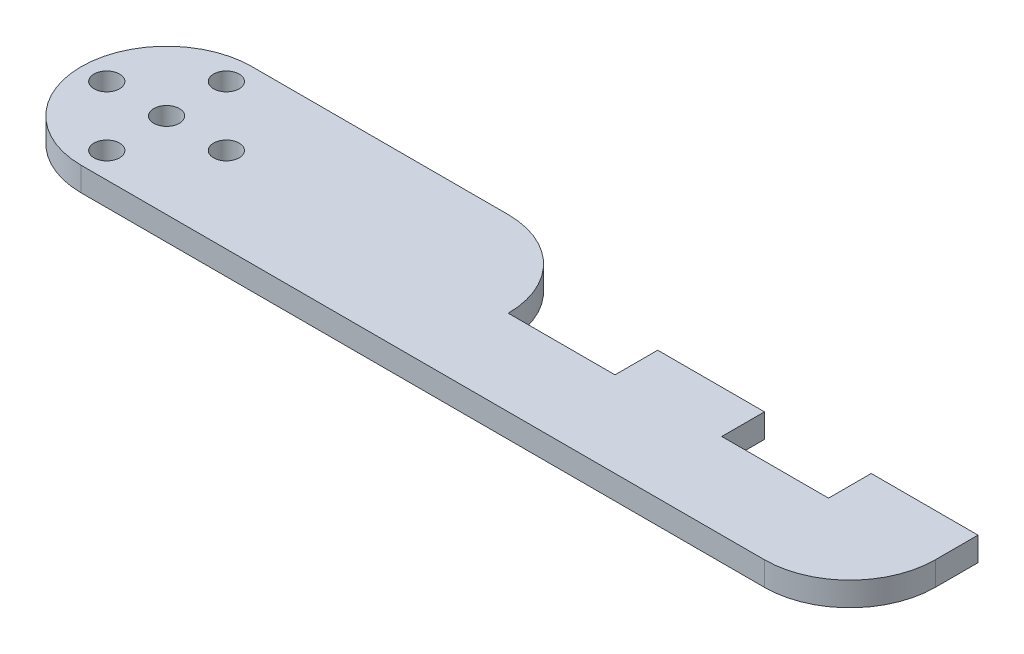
ISO-10303-21;
HEADER;
FILE_DESCRIPTION(('STEP AP214'),'2;1');
FILE_NAME('part.step','',(''),(''),'','','');
FILE_SCHEMA(('AUTOMOTIVE_DESIGN { 1 0 10303 214 1 1 1 1 }'));
ENDSEC;
DATA;
#1=APPLICATION_CONTEXT('core data for automotive mechanical design processes');
#2=APPLICATION_PROTOCOL_DEFINITION('international standard','automotive_design',2000,#1);
#3=PRODUCT_CONTEXT('',#1,'mechanical');
#4=PRODUCT('Part','Part','',(#3));
#5=PRODUCT_RELATED_PRODUCT_CATEGORY('part','',(#4));
#6=PRODUCT_DEFINITION_FORMATION('','',#4);
#7=PRODUCT_DEFINITION_CONTEXT('part definition',#1,'design');
#8=PRODUCT_DEFINITION('design','',#6,#7);
#9=PRODUCT_DEFINITION_SHAPE('','',#8);
#10=(LENGTH_UNIT() NAMED_UNIT(*) SI_UNIT(.MILLI.,.METRE.));
#11=(NAMED_UNIT(*) PLANE_ANGLE_UNIT() SI_UNIT($,.RADIAN.));
#12=(NAMED_UNIT(*) SI_UNIT($,.STERADIAN.) SOLID_ANGLE_UNIT());
#13=UNCERTAINTY_MEASURE_WITH_UNIT(LENGTH_MEASURE(1.E-05),#10,'distance_accuracy_value','');
#14=(GEOMETRIC_REPRESENTATION_CONTEXT(3) GLOBAL_UNCERTAINTY_ASSIGNED_CONTEXT((#13)) GLOBAL_UNIT_ASSIGNED_CONTEXT((#10,
#11,#12)) REPRESENTATION_CONTEXT('',''));
#15=CARTESIAN_POINT('',(0.,0.,0.));
#16=DIRECTION('',(0.,0.,1.));
#17=DIRECTION('',(1.,0.,0.));
#18=AXIS2_PLACEMENT_3D('',#15,#16,#17);
#19=CARTESIAN_POINT('',(0.,2.8,0.));
#20=DIRECTION('',(0.,0.,-1.));
#21=DIRECTION('',(-1.,0.,0.));
#22=AXIS2_PLACEMENT_3D('',#19,#20,#21);
#23=PLANE('',#22);
#24=DIRECTION('',(1.,0.,0.));
#25=VECTOR('',#24,1.);
#26=CARTESIAN_POINT('',(0.,0.,0.));
#27=LINE('',#26,#25);
#28=CARTESIAN_POINT('',(10.,0.,0.));
#29=VERTEX_POINT('',#28);
#30=CARTESIAN_POINT('',(90.,0.,0.));
#31=VERTEX_POINT('',#30);
#32=EDGE_CURVE('E175',#29,#31,#27,.T.);
#33=ORIENTED_EDGE('',*,*,#32,.T.);
#34=DIRECTION('',(0.,-1.,0.));
#35=VECTOR('',#34,1.);
#36=CARTESIAN_POINT('',(90.,2.8,0.));
#37=LINE('',#36,#35);
#38=CARTESIAN_POINT('',(90.,2.8,0.));
#39=VERTEX_POINT('',#38);
#40=EDGE_CURVE('E41',#31,#39,#37,.F.);
#41=ORIENTED_EDGE('',*,*,#40,.T.);
#42=DIRECTION('',(1.,0.,0.));
#43=VECTOR('',#42,1.);
#44=CARTESIAN_POINT('',(0.,2.8,0.));
#45=LINE('',#44,#43);
#46=CARTESIAN_POINT('',(10.,2.8,0.));
#47=VERTEX_POINT('',#46);
#48=EDGE_CURVE('E143',#47,#39,#45,.T.);
#49=ORIENTED_EDGE('',*,*,#48,.F.);
#50=DIRECTION('',(0.,-1.,0.));
#51=VECTOR('',#50,1.);
#52=CARTESIAN_POINT('',(10.,2.8,0.));
#53=LINE('',#52,#51);
#54=EDGE_CURVE('E225',#47,#29,#53,.T.);
#55=ORIENTED_EDGE('',*,*,#54,.T.);
#56=EDGE_LOOP('',(#33,#41,#49,#55));
#57=FACE_BOUND('',#56,.T.);
#58=ADVANCED_FACE('F33',(#57),#23,.F.);
#59=CARTESIAN_POINT('',(100.,2.8,-15.));
#60=DIRECTION('',(-1.,0.,0.));
#61=DIRECTION('',(0.,0.,1.));
#62=AXIS2_PLACEMENT_3D('',#59,#60,#61);
#63=PLANE('',#62);
#64=DIRECTION('',(0.,0.,-1.));
#65=VECTOR('',#64,1.);
#66=CARTESIAN_POINT('',(100.,2.8,-15.));
#67=LINE('',#66,#65);
#68=CARTESIAN_POINT('',(100.,2.8,-10.));
#69=VERTEX_POINT('',#68);
#70=CARTESIAN_POINT('',(100.,2.8,-15.));
#71=VERTEX_POINT('',#70);
#72=EDGE_CURVE('E133',#69,#71,#67,.T.);
#73=ORIENTED_EDGE('',*,*,#72,.F.);
#74=DIRECTION('',(0.,-1.,0.));
#75=VECTOR('',#74,1.);
#76=CARTESIAN_POINT('',(100.,2.8,-10.));
#77=LINE('',#76,#75);
#78=CARTESIAN_POINT('',(100.,0.,-10.));
#79=VERTEX_POINT('',#78);
#80=EDGE_CURVE('E237',#69,#79,#77,.T.);
#81=ORIENTED_EDGE('',*,*,#80,.T.);
#82=DIRECTION('',(0.,0.,-1.));
#83=VECTOR('',#82,1.);
#84=CARTESIAN_POINT('',(100.,0.,-15.));
#85=LINE('',#84,#83);
#86=CARTESIAN_POINT('',(100.,0.,-15.));
#87=VERTEX_POINT('',#86);
#88=EDGE_CURVE('E148',#79,#87,#85,.T.);
#89=ORIENTED_EDGE('',*,*,#88,.T.);
#90=DIRECTION('',(0.,-1.,0.));
#91=VECTOR('',#90,1.);
#92=CARTESIAN_POINT('',(100.,2.8,-15.));
#93=LINE('',#92,#91);
#94=EDGE_CURVE('E146',#71,#87,#93,.T.);
#95=ORIENTED_EDGE('',*,*,#94,.F.);
#96=EDGE_LOOP('',(#73,#81,#89,#95));
#97=FACE_BOUND('',#96,.T.);
#98=ADVANCED_FACE('F147',(#97),#63,.F.);
#99=CARTESIAN_POINT('',(87.5,2.8,-15.));
#100=DIRECTION('',(0.,0.,1.));
#101=DIRECTION('',(1.,0.,0.));
#102=AXIS2_PLACEMENT_3D('',#99,#100,#101);
#103=PLANE('',#102);
#104=DIRECTION('',(-1.,0.,0.));
#105=VECTOR('',#104,1.);
#106=CARTESIAN_POINT('',(87.5,0.,-15.));
#107=LINE('',#106,#105);
#108=CARTESIAN_POINT('',(87.5,0.,-15.));
#109=VERTEX_POINT('',#108);
#110=EDGE_CURVE('E179',#87,#109,#107,.T.);
#111=ORIENTED_EDGE('',*,*,#110,.T.);
#112=DIRECTION('',(0.,-1.,0.));
#113=VECTOR('',#112,1.);
#114=CARTESIAN_POINT('',(87.5,2.8,-15.));
#115=LINE('',#114,#113);
#116=CARTESIAN_POINT('',(87.5,2.8,-15.));
#117=VERTEX_POINT('',#116);
#118=EDGE_CURVE('E152',#117,#109,#115,.T.);
#119=ORIENTED_EDGE('',*,*,#118,.F.);
#120=DIRECTION('',(-1.,0.,0.));
#121=VECTOR('',#120,1.);
#122=CARTESIAN_POINT('',(87.5,2.8,-15.));
#123=LINE('',#122,#121);
#124=EDGE_CURVE('E137',#71,#117,#123,.T.);
#125=ORIENTED_EDGE('',*,*,#124,.F.);
#126=ORIENTED_EDGE('',*,*,#94,.T.);
#127=EDGE_LOOP('',(#111,#119,#125,#126));
#128=FACE_BOUND('',#127,.T.);
#129=ADVANCED_FACE('F154',(#128),#103,.F.);
#130=CARTESIAN_POINT('',(87.5,2.8,-10.));
#131=DIRECTION('',(1.,0.,0.));
#132=DIRECTION('',(0.,0.,-1.));
#133=AXIS2_PLACEMENT_3D('',#130,#131,#132);
#134=PLANE('',#133);
#135=DIRECTION('',(0.,0.,1.));
#136=VECTOR('',#135,1.);
#137=CARTESIAN_POINT('',(87.5,0.,-10.));
#138=LINE('',#137,#136);
#139=CARTESIAN_POINT('',(87.5,0.,-10.));
#140=VERTEX_POINT('',#139);
#141=EDGE_CURVE('E181',#109,#140,#138,.T.);
#142=ORIENTED_EDGE('',*,*,#141,.T.);
#143=DIRECTION('',(0.,-1.,0.));
#144=VECTOR('',#143,1.);
#145=CARTESIAN_POINT('',(87.5,2.8,-10.));
#146=LINE('',#145,#144);
#147=CARTESIAN_POINT('',(87.5,2.8,-10.));
#148=VERTEX_POINT('',#147);
#149=EDGE_CURVE('E210',#148,#140,#146,.T.);
#150=ORIENTED_EDGE('',*,*,#149,.F.);
#151=DIRECTION('',(0.,0.,1.));
#152=VECTOR('',#151,1.);
#153=CARTESIAN_POINT('',(87.5,2.8,-10.));
#154=LINE('',#153,#152);
#155=EDGE_CURVE('E157',#117,#148,#154,.T.);
#156=ORIENTED_EDGE('',*,*,#155,.F.);
#157=ORIENTED_EDGE('',*,*,#118,.T.);
#158=EDGE_LOOP('',(#142,#150,#156,#157));
#159=FACE_BOUND('',#158,.T.);
#160=ADVANCED_FACE('F244',(#159),#134,.F.);
#161=CARTESIAN_POINT('',(75.,2.8,-10.));
#162=DIRECTION('',(0.,0.,1.));
#163=DIRECTION('',(1.,0.,0.));
#164=AXIS2_PLACEMENT_3D('',#161,#162,#163);
#165=PLANE('',#164);
#166=DIRECTION('',(-1.,0.,0.));
#167=VECTOR('',#166,1.);
#168=CARTESIAN_POINT('',(75.,0.,-10.));
#169=LINE('',#168,#167);
#170=CARTESIAN_POINT('',(75.,0.,-10.));
#171=VERTEX_POINT('',#170);
#172=EDGE_CURVE('E183',#140,#171,#169,.T.);
#173=ORIENTED_EDGE('',*,*,#172,.T.);
#174=DIRECTION('',(0.,-1.,0.));
#175=VECTOR('',#174,1.);
#176=CARTESIAN_POINT('',(75.,2.8,-10.));
#177=LINE('',#176,#175);
#178=CARTESIAN_POINT('',(75.,2.8,-10.));
#179=VERTEX_POINT('',#178);
#180=EDGE_CURVE('E207',#179,#171,#177,.T.);
#181=ORIENTED_EDGE('',*,*,#180,.F.);
#182=DIRECTION('',(-1.,0.,0.));
#183=VECTOR('',#182,1.);
#184=CARTESIAN_POINT('',(75.,2.8,-10.));
#185=LINE('',#184,#183);
#186=EDGE_CURVE('E159',#148,#179,#185,.T.);
#187=ORIENTED_EDGE('',*,*,#186,.F.);
#188=ORIENTED_EDGE('',*,*,#149,.T.);
#189=EDGE_LOOP('',(#173,#181,#187,#188));
#190=FACE_BOUND('',#189,.T.);
#191=ADVANCED_FACE('F251',(#190),#165,.F.);
#192=CARTESIAN_POINT('',(75.,2.8,-15.));
#193=DIRECTION('',(-1.,0.,0.));
#194=DIRECTION('',(0.,0.,1.));
#195=AXIS2_PLACEMENT_3D('',#192,#193,#194);
#196=PLANE('',#195);
#197=DIRECTION('',(0.,0.,-1.));
#198=VECTOR('',#197,1.);
#199=CARTESIAN_POINT('',(75.,0.,-15.));
#200=LINE('',#199,#198);
#201=CARTESIAN_POINT('',(75.,0.,-15.));
#202=VERTEX_POINT('',#201);
#203=EDGE_CURVE('E185',#171,#202,#200,.T.);
#204=ORIENTED_EDGE('',*,*,#203,.T.);
#205=DIRECTION('',(0.,-1.,0.));
#206=VECTOR('',#205,1.);
#207=CARTESIAN_POINT('',(75.,2.8,-15.));
#208=LINE('',#207,#206);
#209=CARTESIAN_POINT('',(75.,2.8,-15.));
#210=VERTEX_POINT('',#209);
#211=EDGE_CURVE('E204',#210,#202,#208,.T.);
#212=ORIENTED_EDGE('',*,*,#211,.F.);
#213=DIRECTION('',(0.,0.,-1.));
#214=VECTOR('',#213,1.);
#215=CARTESIAN_POINT('',(75.,2.8,-15.));
#216=LINE('',#215,#214);
#217=EDGE_CURVE('E164',#179,#210,#216,.T.);
#218=ORIENTED_EDGE('',*,*,#217,.F.);
#219=ORIENTED_EDGE('',*,*,#180,.T.);
#220=EDGE_LOOP('',(#204,#212,#218,#219));
#221=FACE_BOUND('',#220,.T.);
#222=ADVANCED_FACE('F254',(#221),#196,.F.);
#223=CARTESIAN_POINT('',(62.5,2.8,-15.));
#224=DIRECTION('',(0.,0.,1.));
#225=DIRECTION('',(1.,0.,0.));
#226=AXIS2_PLACEMENT_3D('',#223,#224,#225);
#227=PLANE('',#226);
#228=DIRECTION('',(-1.,0.,0.));
#229=VECTOR('',#228,1.);
#230=CARTESIAN_POINT('',(62.5,0.,-15.));
#231=LINE('',#230,#229);
#232=CARTESIAN_POINT('',(62.5,0.,-15.));
#233=VERTEX_POINT('',#232);
#234=EDGE_CURVE('E187',#202,#233,#231,.T.);
#235=ORIENTED_EDGE('',*,*,#234,.T.);
#236=DIRECTION('',(0.,-1.,0.));
#237=VECTOR('',#236,1.);
#238=CARTESIAN_POINT('',(62.5,2.8,-15.));
#239=LINE('',#238,#237);
#240=CARTESIAN_POINT('',(62.5,2.8,-15.));
#241=VERTEX_POINT('',#240);
#242=EDGE_CURVE('E201',#241,#233,#239,.T.);
#243=ORIENTED_EDGE('',*,*,#242,.F.);
#244=DIRECTION('',(-1.,0.,0.));
#245=VECTOR('',#244,1.);
#246=CARTESIAN_POINT('',(62.5,2.8,-15.));
#247=LINE('',#246,#245);
#248=EDGE_CURVE('E166',#210,#241,#247,.T.);
#249=ORIENTED_EDGE('',*,*,#248,.F.);
#250=ORIENTED_EDGE('',*,*,#211,.T.);
#251=EDGE_LOOP('',(#235,#243,#249,#250));
#252=FACE_BOUND('',#251,.T.);
#253=ADVANCED_FACE('F259',(#252),#227,.F.);
#254=CARTESIAN_POINT('',(62.5,2.8,-10.));
#255=DIRECTION('',(1.,0.,0.));
#256=DIRECTION('',(0.,0.,-1.));
#257=AXIS2_PLACEMENT_3D('',#254,#255,#256);
#258=PLANE('',#257);
#259=DIRECTION('',(0.,0.,1.));
#260=VECTOR('',#259,1.);
#261=CARTESIAN_POINT('',(62.5,0.,-10.));
#262=LINE('',#261,#260);
#263=CARTESIAN_POINT('',(62.5,0.,-10.));
#264=VERTEX_POINT('',#263);
#265=EDGE_CURVE('E189',#233,#264,#262,.T.);
#266=ORIENTED_EDGE('',*,*,#265,.T.);
#267=DIRECTION('',(0.,-1.,0.));
#268=VECTOR('',#267,1.);
#269=CARTESIAN_POINT('',(62.5,2.8,-10.));
#270=LINE('',#269,#268);
#271=CARTESIAN_POINT('',(62.5,2.8,-10.));
#272=VERTEX_POINT('',#271);
#273=EDGE_CURVE('E198',#272,#264,#270,.T.);
#274=ORIENTED_EDGE('',*,*,#273,.F.);
#275=DIRECTION('',(0.,0.,1.));
#276=VECTOR('',#275,1.);
#277=CARTESIAN_POINT('',(62.5,2.8,-10.));
#278=LINE('',#277,#276);
#279=EDGE_CURVE('E168',#241,#272,#278,.T.);
#280=ORIENTED_EDGE('',*,*,#279,.F.);
#281=ORIENTED_EDGE('',*,*,#242,.T.);
#282=EDGE_LOOP('',(#266,#274,#280,#281));
#283=FACE_BOUND('',#282,.T.);
#284=ADVANCED_FACE('F265',(#283),#258,.F.);
#285=CARTESIAN_POINT('',(50.,2.8,-10.));
#286=DIRECTION('',(0.,0.,1.));
#287=DIRECTION('',(1.,0.,0.));
#288=AXIS2_PLACEMENT_3D('',#285,#286,#287);
#289=PLANE('',#288);
#290=DIRECTION('',(-1.,0.,0.));
#291=VECTOR('',#290,1.);
#292=CARTESIAN_POINT('',(50.,0.,-10.));
#293=LINE('',#292,#291);
#294=CARTESIAN_POINT('',(50.,0.,-10.));
#295=VERTEX_POINT('',#294);
#296=EDGE_CURVE('E191',#264,#295,#293,.T.);
#297=ORIENTED_EDGE('',*,*,#296,.T.);
#298=DIRECTION('',(0.,-1.,0.));
#299=VECTOR('',#298,1.);
#300=CARTESIAN_POINT('',(50.,2.8,-10.));
#301=LINE('',#300,#299);
#302=CARTESIAN_POINT('',(50.,2.8,-10.));
#303=VERTEX_POINT('',#302);
#304=EDGE_CURVE('E174',#303,#295,#301,.T.);
#305=ORIENTED_EDGE('',*,*,#304,.F.);
#306=DIRECTION('',(-1.,0.,0.));
#307=VECTOR('',#306,1.);
#308=CARTESIAN_POINT('',(50.,2.8,-10.));
#309=LINE('',#308,#307);
#310=EDGE_CURVE('E170',#272,#303,#309,.T.);
#311=ORIENTED_EDGE('',*,*,#310,.F.);
#312=ORIENTED_EDGE('',*,*,#273,.T.);
#313=EDGE_LOOP('',(#297,#305,#311,#312));
#314=FACE_BOUND('',#313,.T.);
#315=ADVANCED_FACE('F269',(#314),#289,.F.);
#316=CARTESIAN_POINT('',(50.,2.8,-20.));
#317=DIRECTION('',(0.,0.,1.));
#318=DIRECTION('',(1.,0.,0.));
#319=AXIS2_PLACEMENT_3D('',#316,#317,#318);
#320=PLANE('',#319);
#321=DIRECTION('',(-1.,0.,0.));
#322=VECTOR('',#321,1.);
#323=CARTESIAN_POINT('',(50.,2.8,-20.));
#324=LINE('',#323,#322);
#325=CARTESIAN_POINT('',(40.,2.8,-20.));
#326=VERTEX_POINT('',#325);
#327=CARTESIAN_POINT('',(10.,2.8,-20.));
#328=VERTEX_POINT('',#327);
#329=EDGE_CURVE('E172',#326,#328,#324,.T.);
#330=ORIENTED_EDGE('',*,*,#329,.F.);
#331=DIRECTION('',(0.,-1.,0.));
#332=VECTOR('',#331,1.);
#333=CARTESIAN_POINT('',(40.,2.8,-20.));
#334=LINE('',#333,#332);
#335=CARTESIAN_POINT('',(40.,0.,-20.));
#336=VERTEX_POINT('',#335);
#337=EDGE_CURVE('E227',#326,#336,#334,.T.);
#338=ORIENTED_EDGE('',*,*,#337,.T.);
#339=DIRECTION('',(-1.,0.,0.));
#340=VECTOR('',#339,1.);
#341=CARTESIAN_POINT('',(50.,0.,-20.));
#342=LINE('',#341,#340);
#343=CARTESIAN_POINT('',(10.,0.,-20.));
#344=VERTEX_POINT('',#343);
#345=EDGE_CURVE('E194',#336,#344,#342,.T.);
#346=ORIENTED_EDGE('',*,*,#345,.T.);
#347=DIRECTION('',(0.,-1.,0.));
#348=VECTOR('',#347,1.);
#349=CARTESIAN_POINT('',(10.,2.8,-20.));
#350=LINE('',#349,#348);
#351=EDGE_CURVE('E218',#344,#328,#350,.F.);
#352=ORIENTED_EDGE('',*,*,#351,.T.);
#353=EDGE_LOOP('',(#330,#338,#346,#352));
#354=FACE_BOUND('',#353,.T.);
#355=ADVANCED_FACE('F277',(#354),#320,.F.);
#356=CARTESIAN_POINT('',(0.,2.8,0.));
#357=DIRECTION('',(0.,1.,0.));
#358=DIRECTION('',(0.,0.,1.));
#359=AXIS2_PLACEMENT_3D('',#356,#357,#358);
#360=PLANE('',#359);
#361=CARTESIAN_POINT('',(3.,2.8,-10.));
#362=DIRECTION('',(0.,1.,0.));
#363=DIRECTION('',(0.,0.,1.));
#364=AXIS2_PLACEMENT_3D('',#361,#362,#363);
#365=CIRCLE('',#364,1.5);
#366=CARTESIAN_POINT('',(3.,2.8,-8.5));
#367=VERTEX_POINT('',#366);
#368=EDGE_CURVE('E303',#367,#367,#365,.T.);
#369=ORIENTED_EDGE('',*,*,#368,.F.);
#370=EDGE_LOOP('',(#369));
#371=FACE_BOUND('',#370,.T.);
#372=CARTESIAN_POINT('',(10.,2.8,-3.));
#373=DIRECTION('',(0.,1.,0.));
#374=DIRECTION('',(0.,0.,1.));
#375=AXIS2_PLACEMENT_3D('',#372,#373,#374);
#376=CIRCLE('',#375,1.5);
#377=CARTESIAN_POINT('',(10.,2.8,-1.5));
#378=VERTEX_POINT('',#377);
#379=EDGE_CURVE('E296',#378,#378,#376,.T.);
#380=ORIENTED_EDGE('',*,*,#379,.F.);
#381=EDGE_LOOP('',(#380));
#382=FACE_BOUND('',#381,.T.);
#383=CARTESIAN_POINT('',(17.,2.8,-10.));
#384=DIRECTION('',(0.,1.,0.));
#385=DIRECTION('',(0.,0.,1.));
#386=AXIS2_PLACEMENT_3D('',#383,#384,#385);
#387=CIRCLE('',#386,1.5);
#388=CARTESIAN_POINT('',(17.,2.8,-8.5));
#389=VERTEX_POINT('',#388);
#390=EDGE_CURVE('E314',#389,#389,#387,.T.);
#391=ORIENTED_EDGE('',*,*,#390,.F.);
#392=EDGE_LOOP('',(#391));
#393=FACE_BOUND('',#392,.T.);
#394=CARTESIAN_POINT('',(10.,2.8,-17.));
#395=DIRECTION('',(0.,1.,0.));
#396=DIRECTION('',(0.,0.,1.));
#397=AXIS2_PLACEMENT_3D('',#394,#395,#396);
#398=CIRCLE('',#397,1.5);
#399=CARTESIAN_POINT('',(10.,2.8,-15.5));
#400=VERTEX_POINT('',#399);
#401=EDGE_CURVE('E308',#400,#400,#398,.T.);
#402=ORIENTED_EDGE('',*,*,#401,.F.);
#403=EDGE_LOOP('',(#402));
#404=FACE_BOUND('',#403,.T.);
#405=CARTESIAN_POINT('',(10.,2.8,-10.));
#406=DIRECTION('',(0.,1.,0.));
#407=DIRECTION('',(0.,0.,1.));
#408=AXIS2_PLACEMENT_3D('',#405,#406,#407);
#409=CIRCLE('',#408,1.5);
#410=CARTESIAN_POINT('',(10.,2.8,-8.5));
#411=VERTEX_POINT('',#410);
#412=EDGE_CURVE('E290',#411,#411,#409,.T.);
#413=ORIENTED_EDGE('',*,*,#412,.F.);
#414=EDGE_LOOP('',(#413));
#415=FACE_BOUND('',#414,.T.);
#416=ORIENTED_EDGE('',*,*,#48,.T.);
#417=CARTESIAN_POINT('',(90.,2.8,-10.));
#418=DIRECTION('',(0.,1.,0.));
#419=DIRECTION('',(0.,0.,1.));
#420=AXIS2_PLACEMENT_3D('',#417,#418,#419);
#421=CIRCLE('',#420,10.);
#422=EDGE_CURVE('E11',#39,#69,#421,.T.);
#423=ORIENTED_EDGE('',*,*,#422,.T.);
#424=ORIENTED_EDGE('',*,*,#72,.T.);
#425=ORIENTED_EDGE('',*,*,#124,.T.);
#426=ORIENTED_EDGE('',*,*,#155,.T.);
#427=ORIENTED_EDGE('',*,*,#186,.T.);
#428=ORIENTED_EDGE('',*,*,#217,.T.);
#429=ORIENTED_EDGE('',*,*,#248,.T.);
#430=ORIENTED_EDGE('',*,*,#279,.T.);
#431=ORIENTED_EDGE('',*,*,#310,.T.);
#432=CARTESIAN_POINT('',(40.,2.8,-10.));
#433=DIRECTION('',(0.,1.,0.));
#434=DIRECTION('',(0.,0.,1.));
#435=AXIS2_PLACEMENT_3D('',#432,#433,#434);
#436=CIRCLE('',#435,10.);
#437=EDGE_CURVE('E235',#303,#326,#436,.T.);
#438=ORIENTED_EDGE('',*,*,#437,.T.);
#439=ORIENTED_EDGE('',*,*,#329,.T.);
#440=CARTESIAN_POINT('',(10.,2.8,-10.));
#441=DIRECTION('',(0.,1.,0.));
#442=DIRECTION('',(0.,0.,1.));
#443=AXIS2_PLACEMENT_3D('',#440,#441,#442);
#444=CIRCLE('',#443,10.);
#445=CARTESIAN_POINT('',(0.,2.8,-10.));
#446=VERTEX_POINT('',#445);
#447=EDGE_CURVE('E223',#328,#446,#444,.T.);
#448=ORIENTED_EDGE('',*,*,#447,.T.);
#449=CARTESIAN_POINT('',(10.,2.8,-10.));
#450=DIRECTION('',(0.,1.,0.));
#451=DIRECTION('',(0.,0.,1.));
#452=AXIS2_PLACEMENT_3D('',#449,#450,#451);
#453=CIRCLE('',#452,10.);
#454=EDGE_CURVE('E221',#446,#47,#453,.T.);
#455=ORIENTED_EDGE('',*,*,#454,.T.);
#456=EDGE_LOOP('',(#416,#423,#424,#425,#426,#427,#428,#429,#430,#431,#438,#439,#448,#455));
#457=FACE_BOUND('',#456,.T.);
#458=ADVANCED_FACE('F135',(#371,#382,#393,#404,#415,#457),#360,.T.);
#459=CARTESIAN_POINT('',(0.,0.,0.));
#460=DIRECTION('',(0.,1.,0.));
#461=DIRECTION('',(0.,0.,1.));
#462=AXIS2_PLACEMENT_3D('',#459,#460,#461);
#463=PLANE('',#462);
#464=CARTESIAN_POINT('',(3.,0.,-10.));
#465=DIRECTION('',(0.,1.,0.));
#466=DIRECTION('',(0.,0.,1.));
#467=AXIS2_PLACEMENT_3D('',#464,#465,#466);
#468=CIRCLE('',#467,1.5);
#469=CARTESIAN_POINT('',(3.,0.,-8.5));
#470=VERTEX_POINT('',#469);
#471=EDGE_CURVE('E293',#470,#470,#468,.T.);
#472=ORIENTED_EDGE('',*,*,#471,.T.);
#473=EDGE_LOOP('',(#472));
#474=FACE_BOUND('',#473,.T.);
#475=CARTESIAN_POINT('',(10.,0.,-3.));
#476=DIRECTION('',(0.,1.,0.));
#477=DIRECTION('',(0.,0.,1.));
#478=AXIS2_PLACEMENT_3D('',#475,#476,#477);
#479=CIRCLE('',#478,1.5);
#480=CARTESIAN_POINT('',(10.,0.,-1.5));
#481=VERTEX_POINT('',#480);
#482=EDGE_CURVE('E299',#481,#481,#479,.T.);
#483=ORIENTED_EDGE('',*,*,#482,.T.);
#484=EDGE_LOOP('',(#483));
#485=FACE_BOUND('',#484,.T.);
#486=CARTESIAN_POINT('',(17.,0.,-10.));
#487=DIRECTION('',(0.,1.,0.));
#488=DIRECTION('',(0.,0.,1.));
#489=AXIS2_PLACEMENT_3D('',#486,#487,#488);
#490=CIRCLE('',#489,1.5);
#491=CARTESIAN_POINT('',(17.,0.,-8.5));
#492=VERTEX_POINT('',#491);
#493=EDGE_CURVE('E300',#492,#492,#490,.T.);
#494=ORIENTED_EDGE('',*,*,#493,.T.);
#495=EDGE_LOOP('',(#494));
#496=FACE_BOUND('',#495,.T.);
#497=CARTESIAN_POINT('',(10.,0.,-17.));
#498=DIRECTION('',(0.,1.,0.));
#499=DIRECTION('',(0.,0.,1.));
#500=AXIS2_PLACEMENT_3D('',#497,#498,#499);
#501=CIRCLE('',#500,1.5);
#502=CARTESIAN_POINT('',(10.,0.,-15.5));
#503=VERTEX_POINT('',#502);
#504=EDGE_CURVE('E311',#503,#503,#501,.T.);
#505=ORIENTED_EDGE('',*,*,#504,.T.);
#506=EDGE_LOOP('',(#505));
#507=FACE_BOUND('',#506,.T.);
#508=CARTESIAN_POINT('',(10.,0.,-10.));
#509=DIRECTION('',(0.,1.,0.));
#510=DIRECTION('',(0.,0.,1.));
#511=AXIS2_PLACEMENT_3D('',#508,#509,#510);
#512=CIRCLE('',#511,1.5);
#513=CARTESIAN_POINT('',(10.,0.,-8.5));
#514=VERTEX_POINT('',#513);
#515=EDGE_CURVE('E230',#514,#514,#512,.T.);
#516=ORIENTED_EDGE('',*,*,#515,.T.);
#517=EDGE_LOOP('',(#516));
#518=FACE_BOUND('',#517,.T.);
#519=ORIENTED_EDGE('',*,*,#88,.F.);
#520=CARTESIAN_POINT('',(90.,0.,-10.));
#521=DIRECTION('',(0.,1.,0.));
#522=DIRECTION('',(0.,0.,1.));
#523=AXIS2_PLACEMENT_3D('',#520,#521,#522);
#524=CIRCLE('',#523,10.);
#525=EDGE_CURVE('E55',#79,#31,#524,.F.);
#526=ORIENTED_EDGE('',*,*,#525,.T.);
#527=ORIENTED_EDGE('',*,*,#32,.F.);
#528=CARTESIAN_POINT('',(10.,0.,-10.));
#529=DIRECTION('',(0.,1.,0.));
#530=DIRECTION('',(0.,0.,1.));
#531=AXIS2_PLACEMENT_3D('',#528,#529,#530);
#532=CIRCLE('',#531,10.);
#533=CARTESIAN_POINT('',(0.,0.,-10.));
#534=VERTEX_POINT('',#533);
#535=EDGE_CURVE('E151',#29,#534,#532,.F.);
#536=ORIENTED_EDGE('',*,*,#535,.T.);
#537=CARTESIAN_POINT('',(10.,0.,-10.));
#538=DIRECTION('',(0.,1.,0.));
#539=DIRECTION('',(0.,0.,1.));
#540=AXIS2_PLACEMENT_3D('',#537,#538,#539);
#541=CIRCLE('',#540,10.);
#542=EDGE_CURVE('E215',#534,#344,#541,.F.);
#543=ORIENTED_EDGE('',*,*,#542,.T.);
#544=ORIENTED_EDGE('',*,*,#345,.F.);
#545=CARTESIAN_POINT('',(40.,0.,-10.));
#546=DIRECTION('',(0.,1.,0.));
#547=DIRECTION('',(0.,0.,1.));
#548=AXIS2_PLACEMENT_3D('',#545,#546,#547);
#549=CIRCLE('',#548,10.);
#550=EDGE_CURVE('E233',#336,#295,#549,.F.);
#551=ORIENTED_EDGE('',*,*,#550,.T.);
#552=ORIENTED_EDGE('',*,*,#296,.F.);
#553=ORIENTED_EDGE('',*,*,#265,.F.);
#554=ORIENTED_EDGE('',*,*,#234,.F.);
#555=ORIENTED_EDGE('',*,*,#203,.F.);
#556=ORIENTED_EDGE('',*,*,#172,.F.);
#557=ORIENTED_EDGE('',*,*,#141,.F.);
#558=ORIENTED_EDGE('',*,*,#110,.F.);
#559=EDGE_LOOP('',(#519,#526,#527,#536,#543,#544,#551,#552,#553,#554,#555,#556,#557,#558));
#560=FACE_BOUND('',#559,.T.);
#561=ADVANCED_FACE('F240',(#474,#485,#496,#507,#518,#560),#463,.F.);
#562=CARTESIAN_POINT('',(10.,2.8,-10.));
#563=DIRECTION('',(0.,-1.,0.));
#564=DIRECTION('',(0.,0.,-1.));
#565=AXIS2_PLACEMENT_3D('',#562,#563,#564);
#566=CYLINDRICAL_SURFACE('',#565,10.);
#567=ORIENTED_EDGE('',*,*,#54,.F.);
#568=ORIENTED_EDGE('',*,*,#454,.F.);
#569=DIRECTION('',(0.,-1.,0.));
#570=VECTOR('',#569,1.);
#571=CARTESIAN_POINT('',(0.,2.8,-10.));
#572=LINE('',#571,#570);
#573=EDGE_CURVE('E177',#534,#446,#572,.F.);
#574=ORIENTED_EDGE('',*,*,#573,.F.);
#575=ORIENTED_EDGE('',*,*,#535,.F.);
#576=EDGE_LOOP('',(#567,#568,#574,#575));
#577=FACE_BOUND('',#576,.T.);
#578=ADVANCED_FACE('F287',(#577),#566,.T.);
#579=CARTESIAN_POINT('',(10.,2.8,-10.));
#580=DIRECTION('',(0.,-1.,0.));
#581=DIRECTION('',(0.,0.,-1.));
#582=AXIS2_PLACEMENT_3D('',#579,#580,#581);
#583=CYLINDRICAL_SURFACE('',#582,10.);
#584=ORIENTED_EDGE('',*,*,#447,.F.);
#585=ORIENTED_EDGE('',*,*,#351,.F.);
#586=ORIENTED_EDGE('',*,*,#542,.F.);
#587=ORIENTED_EDGE('',*,*,#573,.T.);
#588=EDGE_LOOP('',(#584,#585,#586,#587));
#589=FACE_BOUND('',#588,.T.);
#590=ADVANCED_FACE('F282',(#589),#583,.T.);
#591=CARTESIAN_POINT('',(10.,0.,-10.));
#592=DIRECTION('',(0.,1.,0.));
#593=DIRECTION('',(0.,0.,1.));
#594=AXIS2_PLACEMENT_3D('',#591,#592,#593);
#595=CYLINDRICAL_SURFACE('',#594,1.5);
#596=ORIENTED_EDGE('',*,*,#515,.F.);
#597=EDGE_LOOP('',(#596));
#598=FACE_BOUND('',#597,.T.);
#599=ORIENTED_EDGE('',*,*,#412,.T.);
#600=EDGE_LOOP('',(#599));
#601=FACE_BOUND('',#600,.T.);
#602=ADVANCED_FACE('F338',(#598,#601),#595,.F.);
#603=CARTESIAN_POINT('',(10.,0.,-17.));
#604=DIRECTION('',(0.,1.,0.));
#605=DIRECTION('',(0.,0.,1.));
#606=AXIS2_PLACEMENT_3D('',#603,#604,#605);
#607=CYLINDRICAL_SURFACE('',#606,1.5);
#608=ORIENTED_EDGE('',*,*,#504,.F.);
#609=EDGE_LOOP('',(#608));
#610=FACE_BOUND('',#609,.T.);
#611=ORIENTED_EDGE('',*,*,#401,.T.);
#612=EDGE_LOOP('',(#611));
#613=FACE_BOUND('',#612,.T.);
#614=ADVANCED_FACE('F326',(#610,#613),#607,.F.);
#615=CARTESIAN_POINT('',(17.,0.,-10.));
#616=DIRECTION('',(0.,1.,0.));
#617=DIRECTION('',(0.,0.,1.));
#618=AXIS2_PLACEMENT_3D('',#615,#616,#617);
#619=CYLINDRICAL_SURFACE('',#618,1.5);
#620=ORIENTED_EDGE('',*,*,#493,.F.);
#621=EDGE_LOOP('',(#620));
#622=FACE_BOUND('',#621,.T.);
#623=ORIENTED_EDGE('',*,*,#390,.T.);
#624=EDGE_LOOP('',(#623));
#625=FACE_BOUND('',#624,.T.);
#626=ADVANCED_FACE('F322',(#622,#625),#619,.F.);
#627=CARTESIAN_POINT('',(10.,0.,-3.));
#628=DIRECTION('',(0.,1.,0.));
#629=DIRECTION('',(0.,0.,1.));
#630=AXIS2_PLACEMENT_3D('',#627,#628,#629);
#631=CYLINDRICAL_SURFACE('',#630,1.5);
#632=ORIENTED_EDGE('',*,*,#482,.F.);
#633=EDGE_LOOP('',(#632));
#634=FACE_BOUND('',#633,.T.);
#635=ORIENTED_EDGE('',*,*,#379,.T.);
#636=EDGE_LOOP('',(#635));
#637=FACE_BOUND('',#636,.T.);
#638=ADVANCED_FACE('F325',(#634,#637),#631,.F.);
#639=CARTESIAN_POINT('',(3.,0.,-10.));
#640=DIRECTION('',(0.,1.,0.));
#641=DIRECTION('',(0.,0.,1.));
#642=AXIS2_PLACEMENT_3D('',#639,#640,#641);
#643=CYLINDRICAL_SURFACE('',#642,1.5);
#644=ORIENTED_EDGE('',*,*,#471,.F.);
#645=EDGE_LOOP('',(#644));
#646=FACE_BOUND('',#645,.T.);
#647=ORIENTED_EDGE('',*,*,#368,.T.);
#648=EDGE_LOOP('',(#647));
#649=FACE_BOUND('',#648,.T.);
#650=ADVANCED_FACE('F361',(#646,#649),#643,.F.);
#651=CARTESIAN_POINT('',(40.,2.8,-10.));
#652=DIRECTION('',(0.,-1.,0.));
#653=DIRECTION('',(0.,0.,-1.));
#654=AXIS2_PLACEMENT_3D('',#651,#652,#653);
#655=CYLINDRICAL_SURFACE('',#654,10.);
#656=ORIENTED_EDGE('',*,*,#437,.F.);
#657=ORIENTED_EDGE('',*,*,#304,.T.);
#658=ORIENTED_EDGE('',*,*,#550,.F.);
#659=ORIENTED_EDGE('',*,*,#337,.F.);
#660=EDGE_LOOP('',(#656,#657,#658,#659));
#661=FACE_BOUND('',#660,.T.);
#662=ADVANCED_FACE('F273',(#661),#655,.T.);
#663=CARTESIAN_POINT('',(90.,2.8,-10.));
#664=DIRECTION('',(0.,-1.,0.));
#665=DIRECTION('',(0.,0.,-1.));
#666=AXIS2_PLACEMENT_3D('',#663,#664,#665);
#667=CYLINDRICAL_SURFACE('',#666,10.);
#668=ORIENTED_EDGE('',*,*,#422,.F.);
#669=ORIENTED_EDGE('',*,*,#40,.F.);
#670=ORIENTED_EDGE('',*,*,#525,.F.);
#671=ORIENTED_EDGE('',*,*,#80,.F.);
#672=EDGE_LOOP('',(#668,#669,#670,#671));
#673=FACE_BOUND('',#672,.T.);
#674=ADVANCED_FACE('F35',(#673),#667,.T.);
#675=CLOSED_SHELL('',(#58,#98,#129,#160,#191,#222,#253,#284,#315,#355,#458,#561,#578,#590,#602,
#614,#626,#638,#650,#662,#674));
#676=MANIFOLD_SOLID_BREP('B2',#675);
#677=ADVANCED_BREP_SHAPE_REPRESENTATION('',(#18,#676),#14);
#678=SHAPE_DEFINITION_REPRESENTATION(#9,#677);
ENDSEC;
END-ISO-10303-21;
